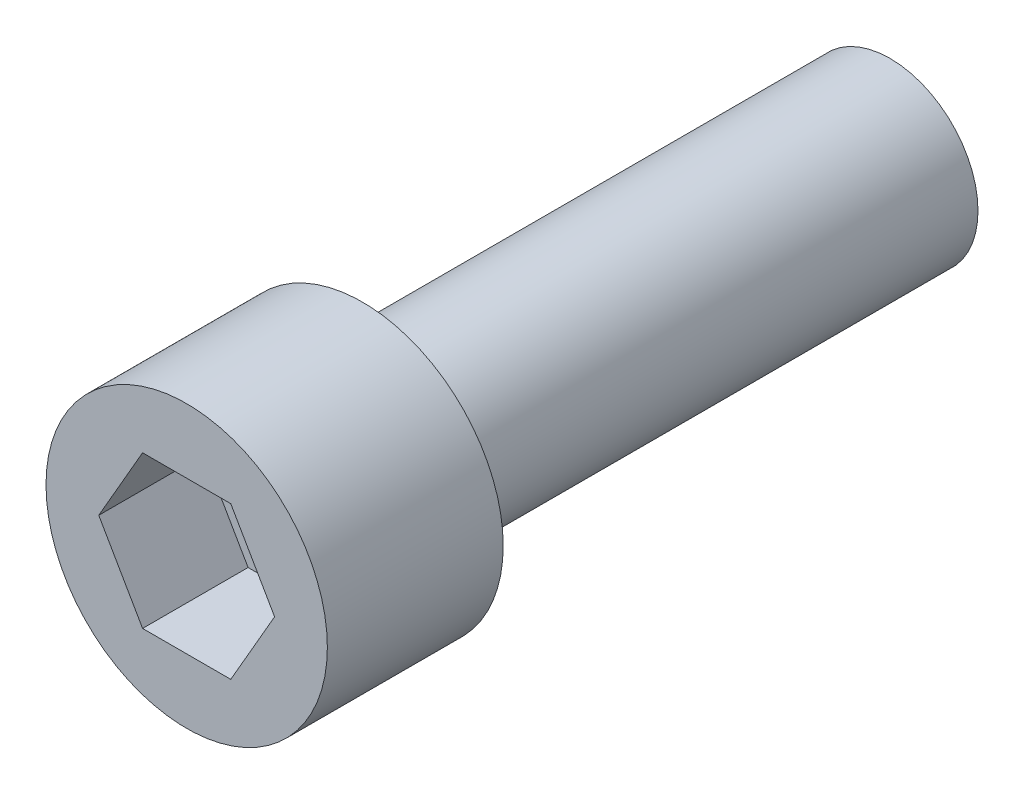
from build123d import *

# Parameters (mm, degrees)
ESQUISSE1_R             = 4
BASE_EXTRUSION_DEPTH    = 5
ENL_V_MAT_EXTRU_1_DEPTH = 3
ESQUISSE4_R             = 2.5
BOSS_EXTRU_3_DEPTH      = 15


with BuildPart() as part:
    # Esquisse1 → Base-Extrusion (new body)
    with BuildSketch(Plane.XY):
        Circle(ESQUISSE1_R)
    extrude(amount=BASE_EXTRUSION_DEPTH)

    # Esquisse3 → Enl_v. mat.-Extru.1 (cut)
    with BuildSketch(Plane.XY.offset(5)):
        Polygon((-2.5, 0), (-1.253634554, 2.162961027), (1.253634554, 2.162961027), (2.5, 0), (1.253634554, -2.162961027), (-1.253634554, -2.162961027), align=None)
    extrude(amount=-ENL_V_MAT_EXTRU_1_DEPTH, mode=Mode.SUBTRACT)

    # Esquisse4 → Boss.-Extru.3 (add)
    with BuildSketch(Plane(origin=(0, 0, 0), x_dir=(-1, 0, 0), z_dir=(0, 0, -1))):
        Circle(ESQUISSE4_R)
    extrude(amount=BOSS_EXTRU_3_DEPTH)


solid = part.part
